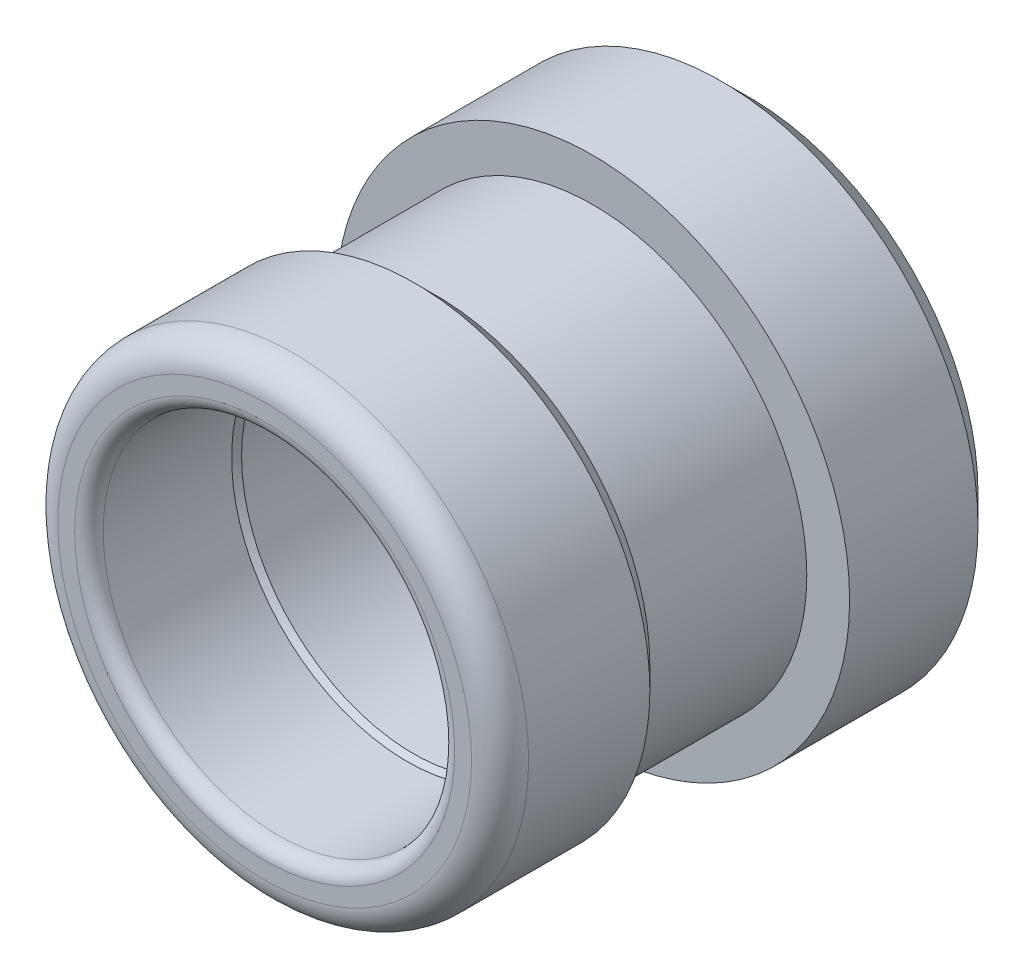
from build123d import *

# Parameters (mm, degrees)
FILLET1_R     = 0.79375
CHAMFER1_SIZE = 1.5875
FILLET2_R     = 1.5875
FILLET3_R     = 0.79375


with BuildPart() as part:
    # Sketch1 → Revolve1 (revolve)
    with BuildSketch(Plane(origin=(0, 0, 0), x_dir=(0, 0, -1), z_dir=(1, 0, 0)), mode=Mode.PRIVATE) as revolve1_sk:
        Polygon((-13.49375, 0), (-13.49375, -13.096875), (-5.159375, -13.096875), (-3.96875, -11.90625), (4.7625, -11.90625), (4.7625, -14.2875), (13.49375, -14.2875), (13.49375, 0), align=None)
    revolve(revolve1_sk.sketch.rotate(Axis((0, 0, 20.557359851), (0, 0, -1)), 270), axis=Axis((0, 0, 20.557359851), (0, 0, -1)))

    # Sketch2 → Cut-Revolve1 (revolve, cut)
    with BuildSketch(Plane(origin=(0, 0, 0), x_dir=(0, 0, -1), z_dir=(1, 0, 0)), mode=Mode.PRIVATE) as cut_revolve1_sk:
        Polygon((-13.49375, 9.779), (-5.55625, 9.779), (-5.204297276, 9.5758), (7.527925, 9.5758), (7.527925, 12.5984), (12.303125, 12.5984), (12.303125, 9.5758), (13.49375, 9.5758), (13.49375, 0), (-13.49375, 0), align=None)
    revolve(cut_revolve1_sk.sketch.rotate(Axis((0, 0, 19.586341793), (0, 0, -1)), 90), axis=Axis((0, 0, 19.586341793), (0, 0, -1)), mode=Mode.SUBTRACT)

    # Fillet1
    fillet1_edges = [part.edges().sort_by_distance(p)[0] for p in [
        (-12.5984, 0, -12.303125),
        (-12.5984, 0, -7.527925),
    ]]
    fillet(fillet1_edges, radius=FILLET1_R)

    # Chamfer1
    chamfer1_edges = [part.edges().sort_by_distance(p)[0] for p in [
        (-14.2875, 0, -13.49375),
    ]]
    chamfer(chamfer1_edges, length=CHAMFER1_SIZE)

    # Fillet2
    fillet2_edges = [part.edges().sort_by_distance(p)[0] for p in [
        (-13.096875, 0, 13.49375),
    ]]
    fillet(fillet2_edges, radius=FILLET2_R)

    # Fillet3
    fillet3_edges = [part.edges().sort_by_distance(p)[0] for p in [
        (-9.779, 0, 13.49375),
    ]]
    fillet(fillet3_edges, radius=FILLET3_R)


solid = part.part
